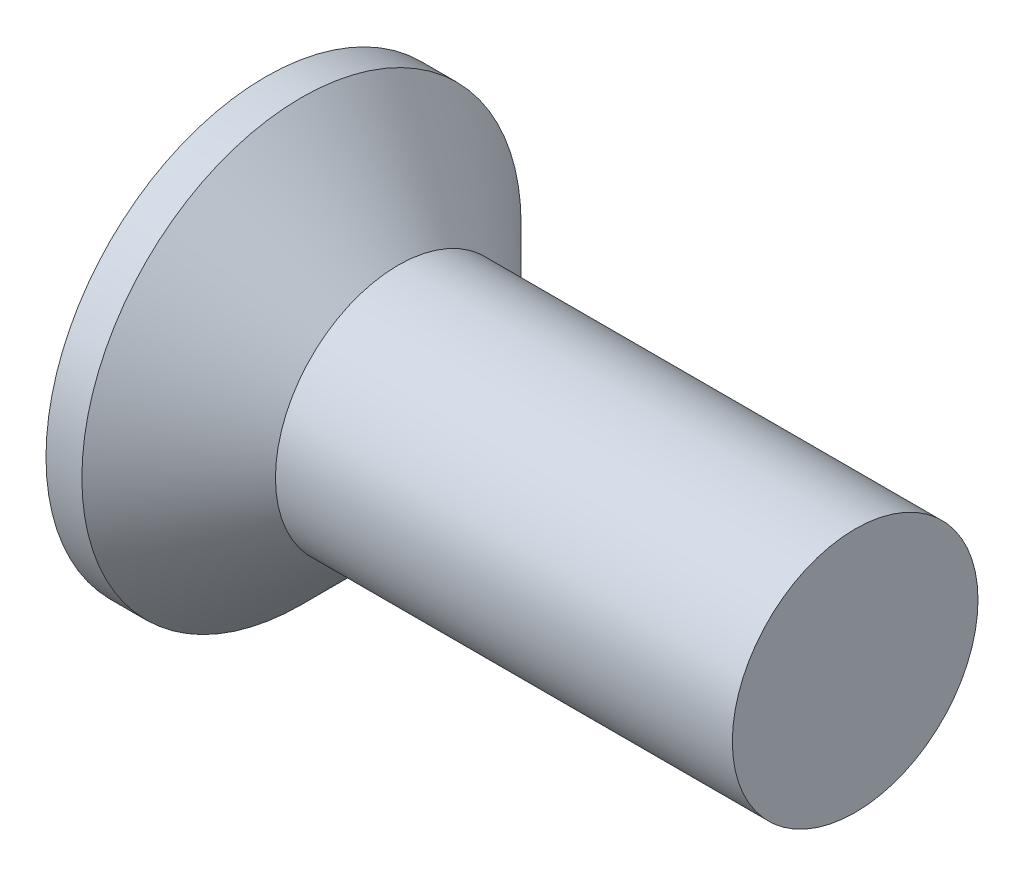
ISO-10303-21;
HEADER;
FILE_DESCRIPTION(('STEP AP214'),'2;1');
FILE_NAME('part.step','',(''),(''),'','','');
FILE_SCHEMA(('AUTOMOTIVE_DESIGN { 1 0 10303 214 1 1 1 1 }'));
ENDSEC;
DATA;
#1=APPLICATION_CONTEXT('core data for automotive mechanical design processes');
#2=APPLICATION_PROTOCOL_DEFINITION('international standard','automotive_design',2000,#1);
#3=PRODUCT_CONTEXT('',#1,'mechanical');
#4=PRODUCT('Part','Part','',(#3));
#5=PRODUCT_RELATED_PRODUCT_CATEGORY('part','',(#4));
#6=PRODUCT_DEFINITION_FORMATION('','',#4);
#7=PRODUCT_DEFINITION_CONTEXT('part definition',#1,'design');
#8=PRODUCT_DEFINITION('design','',#6,#7);
#9=PRODUCT_DEFINITION_SHAPE('','',#8);
#10=(LENGTH_UNIT() NAMED_UNIT(*) SI_UNIT(.MILLI.,.METRE.));
#11=(NAMED_UNIT(*) PLANE_ANGLE_UNIT() SI_UNIT($,.RADIAN.));
#12=(NAMED_UNIT(*) SI_UNIT($,.STERADIAN.) SOLID_ANGLE_UNIT());
#13=UNCERTAINTY_MEASURE_WITH_UNIT(LENGTH_MEASURE(1.E-05),#10,'distance_accuracy_value','');
#14=(GEOMETRIC_REPRESENTATION_CONTEXT(3) GLOBAL_UNCERTAINTY_ASSIGNED_CONTEXT((#13)) GLOBAL_UNIT_ASSIGNED_CONTEXT((#10,
#11,#12)) REPRESENTATION_CONTEXT('',''));
#15=CARTESIAN_POINT('',(0.,0.,0.));
#16=DIRECTION('',(0.,0.,1.));
#17=DIRECTION('',(1.,0.,0.));
#18=AXIS2_PLACEMENT_3D('',#15,#16,#17);
#19=CARTESIAN_POINT('',(0.,4.46999999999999,0.));
#20=DIRECTION('',(-1.,0.,0.));
#21=DIRECTION('',(0.,0.,1.));
#22=AXIS2_PLACEMENT_3D('',#19,#20,#21);
#23=PLANE('',#22);
#24=CARTESIAN_POINT('',(0.,0.,0.));
#25=DIRECTION('',(1.,0.,0.));
#26=DIRECTION('',(0.,0.,-1.));
#27=AXIS2_PLACEMENT_3D('',#24,#25,#26);
#28=CIRCLE('',#27,4.46999999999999);
#29=CARTESIAN_POINT('',(0.,0.,-4.46999999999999));
#30=VERTEX_POINT('',#29);
#31=EDGE_CURVE('E181',#30,#30,#28,.T.);
#32=ORIENTED_EDGE('',*,*,#31,.F.);
#33=EDGE_LOOP('',(#32));
#34=FACE_BOUND('',#33,.T.);
#35=DIRECTION('',(0.,1.,0.));
#36=VECTOR('',#35,1.);
#37=CARTESIAN_POINT('',(0.,-0.52,-0.52));
#38=LINE('',#37,#36);
#39=CARTESIAN_POINT('',(0.,-2.6,-0.52));
#40=VERTEX_POINT('',#39);
#41=CARTESIAN_POINT('',(0.,-0.82,-0.52));
#42=VERTEX_POINT('',#41);
#43=EDGE_CURVE('E307',#40,#42,#38,.T.);
#44=ORIENTED_EDGE('',*,*,#43,.T.);
#45=CARTESIAN_POINT('',(0.,-0.82,-0.82));
#46=DIRECTION('',(-1.,0.,0.));
#47=DIRECTION('',(0.,0.,1.));
#48=AXIS2_PLACEMENT_3D('',#45,#46,#47);
#49=CIRCLE('',#48,0.3);
#50=CARTESIAN_POINT('',(0.,-0.52,-0.82));
#51=VERTEX_POINT('',#50);
#52=EDGE_CURVE('E186',#42,#51,#49,.T.);
#53=ORIENTED_EDGE('',*,*,#52,.T.);
#54=DIRECTION('',(0.,0.,-1.));
#55=VECTOR('',#54,1.);
#56=CARTESIAN_POINT('',(0.,-0.52,-0.52));
#57=LINE('',#56,#55);
#58=CARTESIAN_POINT('',(0.,-0.52,-2.6));
#59=VERTEX_POINT('',#58);
#60=EDGE_CURVE('E309',#51,#59,#57,.T.);
#61=ORIENTED_EDGE('',*,*,#60,.T.);
#62=DIRECTION('',(0.,1.,0.));
#63=VECTOR('',#62,1.);
#64=CARTESIAN_POINT('',(0.,0.52,-2.6));
#65=LINE('',#64,#63);
#66=CARTESIAN_POINT('',(0.,0.52,-2.6));
#67=VERTEX_POINT('',#66);
#68=EDGE_CURVE('E311',#59,#67,#65,.T.);
#69=ORIENTED_EDGE('',*,*,#68,.T.);
#70=DIRECTION('',(0.,0.,1.));
#71=VECTOR('',#70,1.);
#72=CARTESIAN_POINT('',(0.,0.52,-0.52));
#73=LINE('',#72,#71);
#74=CARTESIAN_POINT('',(0.,0.52,-0.82));
#75=VERTEX_POINT('',#74);
#76=EDGE_CURVE('E314',#67,#75,#73,.T.);
#77=ORIENTED_EDGE('',*,*,#76,.T.);
#78=CARTESIAN_POINT('',(0.,0.82,-0.82));
#79=DIRECTION('',(-1.,0.,0.));
#80=DIRECTION('',(0.,0.,1.));
#81=AXIS2_PLACEMENT_3D('',#78,#79,#80);
#82=CIRCLE('',#81,0.3);
#83=CARTESIAN_POINT('',(0.,0.82,-0.52));
#84=VERTEX_POINT('',#83);
#85=EDGE_CURVE('E184',#75,#84,#82,.T.);
#86=ORIENTED_EDGE('',*,*,#85,.T.);
#87=DIRECTION('',(0.,1.,0.));
#88=VECTOR('',#87,1.);
#89=CARTESIAN_POINT('',(0.,0.52,-0.52));
#90=LINE('',#89,#88);
#91=CARTESIAN_POINT('',(0.,2.6,-0.52));
#92=VERTEX_POINT('',#91);
#93=EDGE_CURVE('E317',#84,#92,#90,.T.);
#94=ORIENTED_EDGE('',*,*,#93,.T.);
#95=DIRECTION('',(0.,0.,1.));
#96=VECTOR('',#95,1.);
#97=CARTESIAN_POINT('',(0.,2.6,-0.52));
#98=LINE('',#97,#96);
#99=CARTESIAN_POINT('',(0.,2.6,0.52));
#100=VERTEX_POINT('',#99);
#101=EDGE_CURVE('E319',#92,#100,#98,.T.);
#102=ORIENTED_EDGE('',*,*,#101,.T.);
#103=DIRECTION('',(0.,-1.,0.));
#104=VECTOR('',#103,1.);
#105=CARTESIAN_POINT('',(0.,0.52,0.52));
#106=LINE('',#105,#104);
#107=CARTESIAN_POINT('',(0.,0.82,0.52));
#108=VERTEX_POINT('',#107);
#109=EDGE_CURVE('E322',#100,#108,#106,.T.);
#110=ORIENTED_EDGE('',*,*,#109,.T.);
#111=CARTESIAN_POINT('',(0.,0.82,0.82));
#112=DIRECTION('',(-1.,0.,0.));
#113=DIRECTION('',(0.,0.,1.));
#114=AXIS2_PLACEMENT_3D('',#111,#112,#113);
#115=CIRCLE('',#114,0.3);
#116=CARTESIAN_POINT('',(0.,0.52,0.82));
#117=VERTEX_POINT('',#116);
#118=EDGE_CURVE('E149',#108,#117,#115,.T.);
#119=ORIENTED_EDGE('',*,*,#118,.T.);
#120=DIRECTION('',(0.,0.,1.));
#121=VECTOR('',#120,1.);
#122=CARTESIAN_POINT('',(0.,0.52,0.52));
#123=LINE('',#122,#121);
#124=CARTESIAN_POINT('',(0.,0.519999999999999,2.6));
#125=VERTEX_POINT('',#124);
#126=EDGE_CURVE('E143',#117,#125,#123,.T.);
#127=ORIENTED_EDGE('',*,*,#126,.T.);
#128=DIRECTION('',(0.,-1.,0.));
#129=VECTOR('',#128,1.);
#130=CARTESIAN_POINT('',(0.,0.519999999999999,2.6));
#131=LINE('',#130,#129);
#132=CARTESIAN_POINT('',(0.,-0.520000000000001,2.6));
#133=VERTEX_POINT('',#132);
#134=EDGE_CURVE('E147',#125,#133,#131,.T.);
#135=ORIENTED_EDGE('',*,*,#134,.T.);
#136=DIRECTION('',(0.,0.,-1.));
#137=VECTOR('',#136,1.);
#138=CARTESIAN_POINT('',(0.,-0.52,0.52));
#139=LINE('',#138,#137);
#140=CARTESIAN_POINT('',(0.,-0.52,0.82));
#141=VERTEX_POINT('',#140);
#142=EDGE_CURVE('E161',#133,#141,#139,.T.);
#143=ORIENTED_EDGE('',*,*,#142,.T.);
#144=CARTESIAN_POINT('',(0.,-0.82,0.819999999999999));
#145=DIRECTION('',(-1.,0.,0.));
#146=DIRECTION('',(0.,0.,1.));
#147=AXIS2_PLACEMENT_3D('',#144,#145,#146);
#148=CIRCLE('',#147,0.3);
#149=CARTESIAN_POINT('',(0.,-0.82,0.52));
#150=VERTEX_POINT('',#149);
#151=EDGE_CURVE('E180',#141,#150,#148,.T.);
#152=ORIENTED_EDGE('',*,*,#151,.T.);
#153=DIRECTION('',(0.,-1.,0.));
#154=VECTOR('',#153,1.);
#155=CARTESIAN_POINT('',(0.,-0.52,0.52));
#156=LINE('',#155,#154);
#157=CARTESIAN_POINT('',(0.,-2.6,0.519999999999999));
#158=VERTEX_POINT('',#157);
#159=EDGE_CURVE('E302',#150,#158,#156,.T.);
#160=ORIENTED_EDGE('',*,*,#159,.T.);
#161=DIRECTION('',(0.,0.,-1.));
#162=VECTOR('',#161,1.);
#163=CARTESIAN_POINT('',(0.,-2.6,-0.52));
#164=LINE('',#163,#162);
#165=EDGE_CURVE('E304',#158,#40,#164,.T.);
#166=ORIENTED_EDGE('',*,*,#165,.T.);
#167=EDGE_LOOP('',(#44,#53,#61,#69,#77,#86,#94,#102,#110,#119,#127,#135,#143,#152,#160,#166));
#168=FACE_BOUND('',#167,.T.);
#169=ADVANCED_FACE('F30',(#34,#168),#23,.T.);
#170=CARTESIAN_POINT('',(12.,2.49999999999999,0.));
#171=DIRECTION('',(1.,0.,0.));
#172=DIRECTION('',(0.,0.,-1.));
#173=AXIS2_PLACEMENT_3D('',#170,#171,#172);
#174=PLANE('',#173);
#175=CARTESIAN_POINT('',(12.,0.,0.));
#176=DIRECTION('',(1.,0.,0.));
#177=DIRECTION('',(0.,0.,-1.));
#178=AXIS2_PLACEMENT_3D('',#175,#176,#177);
#179=CIRCLE('',#178,2.49999999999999);
#180=CARTESIAN_POINT('',(12.,0.,-2.49999999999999));
#181=VERTEX_POINT('',#180);
#182=EDGE_CURVE('E167',#181,#181,#179,.T.);
#183=ORIENTED_EDGE('',*,*,#182,.T.);
#184=EDGE_LOOP('',(#183));
#185=FACE_BOUND('',#184,.T.);
#186=ADVANCED_FACE('F234',(#185),#174,.T.);
#187=CARTESIAN_POINT('',(4.51581291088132,0.,0.));
#188=DIRECTION('',(1.,0.,0.));
#189=DIRECTION('',(0.,0.,-1.));
#190=AXIS2_PLACEMENT_3D('',#187,#188,#189);
#191=CYLINDRICAL_SURFACE('',#190,4.46999999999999);
#192=ORIENTED_EDGE('',*,*,#31,.T.);
#193=EDGE_LOOP('',(#192));
#194=FACE_BOUND('',#193,.T.);
#195=CARTESIAN_POINT('',(0.730000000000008,0.,0.));
#196=DIRECTION('',(1.,0.,0.));
#197=DIRECTION('',(0.,0.,-1.));
#198=AXIS2_PLACEMENT_3D('',#195,#196,#197);
#199=CIRCLE('',#198,4.46999999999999);
#200=CARTESIAN_POINT('',(0.730000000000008,0.,-4.46999999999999));
#201=VERTEX_POINT('',#200);
#202=EDGE_CURVE('E326',#201,#201,#199,.T.);
#203=ORIENTED_EDGE('',*,*,#202,.F.);
#204=EDGE_LOOP('',(#203));
#205=FACE_BOUND('',#204,.T.);
#206=ADVANCED_FACE('F240',(#194,#205),#191,.T.);
#207=CARTESIAN_POINT('',(2.7,0.,0.));
#208=DIRECTION('',(-1.,0.,0.));
#209=DIRECTION('',(0.,0.,1.));
#210=AXIS2_PLACEMENT_3D('',#207,#208,#209);
#211=CONICAL_SURFACE('',#210,2.49999999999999,0.78539816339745);
#212=ORIENTED_EDGE('',*,*,#202,.T.);
#213=EDGE_LOOP('',(#212));
#214=FACE_BOUND('',#213,.T.);
#215=CARTESIAN_POINT('',(2.7,0.,0.));
#216=DIRECTION('',(1.,0.,0.));
#217=DIRECTION('',(0.,0.,-1.));
#218=AXIS2_PLACEMENT_3D('',#215,#216,#217);
#219=CIRCLE('',#218,2.49999999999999);
#220=CARTESIAN_POINT('',(2.7,0.,-2.49999999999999));
#221=VERTEX_POINT('',#220);
#222=EDGE_CURVE('E170',#221,#221,#219,.T.);
#223=ORIENTED_EDGE('',*,*,#222,.F.);
#224=EDGE_LOOP('',(#223));
#225=FACE_BOUND('',#224,.T.);
#226=ADVANCED_FACE('F362',(#214,#225),#211,.T.);
#227=CARTESIAN_POINT('',(4.51581291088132,0.,0.));
#228=DIRECTION('',(1.,0.,0.));
#229=DIRECTION('',(0.,0.,-1.));
#230=AXIS2_PLACEMENT_3D('',#227,#228,#229);
#231=CYLINDRICAL_SURFACE('',#230,2.49999999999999);
#232=ORIENTED_EDGE('',*,*,#222,.T.);
#233=EDGE_LOOP('',(#232));
#234=FACE_BOUND('',#233,.T.);
#235=ORIENTED_EDGE('',*,*,#182,.F.);
#236=EDGE_LOOP('',(#235));
#237=FACE_BOUND('',#236,.T.);
#238=ADVANCED_FACE('F360',(#234,#237),#231,.T.);
#239=CARTESIAN_POINT('',(1.35,0.52,0.52));
#240=DIRECTION('',(0.,-1.,0.));
#241=DIRECTION('',(0.,0.,-1.));
#242=AXIS2_PLACEMENT_3D('',#239,#240,#241);
#243=PLANE('',#242);
#244=ORIENTED_EDGE('',*,*,#126,.F.);
#245=DIRECTION('',(-1.,0.,0.));
#246=VECTOR('',#245,1.);
#247=CARTESIAN_POINT('',(1.35,0.52,0.82));
#248=LINE('',#247,#246);
#249=CARTESIAN_POINT('',(1.35,0.52,0.82));
#250=VERTEX_POINT('',#249);
#251=EDGE_CURVE('E198',#117,#250,#248,.F.);
#252=ORIENTED_EDGE('',*,*,#251,.T.);
#253=DIRECTION('',(0.,0.,1.));
#254=VECTOR('',#253,1.);
#255=CARTESIAN_POINT('',(1.35,0.52,0.52));
#256=LINE('',#255,#254);
#257=CARTESIAN_POINT('',(1.35,0.52,1.820577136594));
#258=VERTEX_POINT('',#257);
#259=EDGE_CURVE('E165',#250,#258,#256,.T.);
#260=ORIENTED_EDGE('',*,*,#259,.T.);
#261=DIRECTION('',(-0.866025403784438,0.,0.500000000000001));
#262=VECTOR('',#261,1.);
#263=CARTESIAN_POINT('',(0.,0.519999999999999,2.6));
#264=LINE('',#263,#262);
#265=EDGE_CURVE('E157',#258,#125,#264,.T.);
#266=ORIENTED_EDGE('',*,*,#265,.T.);
#267=EDGE_LOOP('',(#244,#252,#260,#266));
#268=FACE_BOUND('',#267,.T.);
#269=ADVANCED_FACE('F163',(#268),#243,.T.);
#270=CARTESIAN_POINT('',(0.,0.519999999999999,2.6));
#271=DIRECTION('',(-0.500000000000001,0.,-0.866025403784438));
#272=DIRECTION('',(-0.866025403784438,0.,0.500000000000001));
#273=AXIS2_PLACEMENT_3D('',#270,#271,#272);
#274=PLANE('',#273);
#275=ORIENTED_EDGE('',*,*,#134,.F.);
#276=ORIENTED_EDGE('',*,*,#265,.F.);
#277=DIRECTION('',(0.,-1.,0.));
#278=VECTOR('',#277,1.);
#279=CARTESIAN_POINT('',(1.35,0.52,1.820577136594));
#280=LINE('',#279,#278);
#281=CARTESIAN_POINT('',(1.35,-0.52,1.820577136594));
#282=VERTEX_POINT('',#281);
#283=EDGE_CURVE('E176',#258,#282,#280,.T.);
#284=ORIENTED_EDGE('',*,*,#283,.T.);
#285=DIRECTION('',(-0.866025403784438,0.,0.500000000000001));
#286=VECTOR('',#285,1.);
#287=CARTESIAN_POINT('',(1.91316641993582,-0.52,1.4954328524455));
#288=LINE('',#287,#286);
#289=EDGE_CURVE('E159',#282,#133,#288,.T.);
#290=ORIENTED_EDGE('',*,*,#289,.T.);
#291=EDGE_LOOP('',(#275,#276,#284,#290));
#292=FACE_BOUND('',#291,.T.);
#293=ADVANCED_FACE('F156',(#292),#274,.T.);
#294=CARTESIAN_POINT('',(1.35,-0.52,0.52));
#295=DIRECTION('',(0.,1.,0.));
#296=DIRECTION('',(0.,0.,1.));
#297=AXIS2_PLACEMENT_3D('',#294,#295,#296);
#298=PLANE('',#297);
#299=DIRECTION('',(0.,0.,-1.));
#300=VECTOR('',#299,1.);
#301=CARTESIAN_POINT('',(1.35,-0.52,0.52));
#302=LINE('',#301,#300);
#303=CARTESIAN_POINT('',(1.35,-0.52,0.82));
#304=VERTEX_POINT('',#303);
#305=EDGE_CURVE('E348',#282,#304,#302,.T.);
#306=ORIENTED_EDGE('',*,*,#305,.T.);
#307=DIRECTION('',(-1.,0.,0.));
#308=VECTOR('',#307,1.);
#309=CARTESIAN_POINT('',(1.35,-0.52,0.82));
#310=LINE('',#309,#308);
#311=EDGE_CURVE('E200',#304,#141,#310,.T.);
#312=ORIENTED_EDGE('',*,*,#311,.T.);
#313=ORIENTED_EDGE('',*,*,#142,.F.);
#314=ORIENTED_EDGE('',*,*,#289,.F.);
#315=EDGE_LOOP('',(#306,#312,#313,#314));
#316=FACE_BOUND('',#315,.T.);
#317=ADVANCED_FACE('F254',(#316),#298,.T.);
#318=CARTESIAN_POINT('',(1.35,-0.52,0.52));
#319=DIRECTION('',(0.,0.,-1.));
#320=DIRECTION('',(0.,1.,0.));
#321=AXIS2_PLACEMENT_3D('',#318,#319,#320);
#322=PLANE('',#321);
#323=ORIENTED_EDGE('',*,*,#159,.F.);
#324=DIRECTION('',(-1.,0.,0.));
#325=VECTOR('',#324,1.);
#326=CARTESIAN_POINT('',(1.35,-0.82,0.52));
#327=LINE('',#326,#325);
#328=CARTESIAN_POINT('',(1.35,-0.82,0.52));
#329=VERTEX_POINT('',#328);
#330=EDGE_CURVE('E45',#150,#329,#327,.F.);
#331=ORIENTED_EDGE('',*,*,#330,.T.);
#332=DIRECTION('',(0.,-1.,0.));
#333=VECTOR('',#332,1.);
#334=CARTESIAN_POINT('',(1.35,-0.52,0.52));
#335=LINE('',#334,#333);
#336=CARTESIAN_POINT('',(1.35,-1.820577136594,0.519999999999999));
#337=VERTEX_POINT('',#336);
#338=EDGE_CURVE('E291',#329,#337,#335,.T.);
#339=ORIENTED_EDGE('',*,*,#338,.T.);
#340=DIRECTION('',(-0.866025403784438,-0.500000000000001,0.));
#341=VECTOR('',#340,1.);
#342=CARTESIAN_POINT('',(0.,-2.6,0.519999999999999));
#343=LINE('',#342,#341);
#344=EDGE_CURVE('E172',#337,#158,#343,.T.);
#345=ORIENTED_EDGE('',*,*,#344,.T.);
#346=EDGE_LOOP('',(#323,#331,#339,#345));
#347=FACE_BOUND('',#346,.T.);
#348=ADVANCED_FACE('F259',(#347),#322,.T.);
#349=CARTESIAN_POINT('',(0.,-2.6,-0.52));
#350=DIRECTION('',(-0.500000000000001,0.866025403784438,0.));
#351=DIRECTION('',(-0.866025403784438,-0.500000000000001,0.));
#352=AXIS2_PLACEMENT_3D('',#349,#350,#351);
#353=PLANE('',#352);
#354=ORIENTED_EDGE('',*,*,#165,.F.);
#355=ORIENTED_EDGE('',*,*,#344,.F.);
#356=DIRECTION('',(0.,0.,-1.));
#357=VECTOR('',#356,1.);
#358=CARTESIAN_POINT('',(1.35,-1.820577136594,-0.52));
#359=LINE('',#358,#357);
#360=CARTESIAN_POINT('',(1.35,-1.820577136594,-0.52));
#361=VERTEX_POINT('',#360);
#362=EDGE_CURVE('E287',#337,#361,#359,.T.);
#363=ORIENTED_EDGE('',*,*,#362,.T.);
#364=DIRECTION('',(-0.866025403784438,-0.500000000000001,0.));
#365=VECTOR('',#364,1.);
#366=CARTESIAN_POINT('',(1.91316641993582,-1.4954328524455,-0.52));
#367=LINE('',#366,#365);
#368=EDGE_CURVE('E286',#361,#40,#367,.T.);
#369=ORIENTED_EDGE('',*,*,#368,.T.);
#370=EDGE_LOOP('',(#354,#355,#363,#369));
#371=FACE_BOUND('',#370,.T.);
#372=ADVANCED_FACE('F255',(#371),#353,.T.);
#373=CARTESIAN_POINT('',(1.35,-0.52,-0.52));
#374=DIRECTION('',(0.,0.,1.));
#375=DIRECTION('',(0.,-1.,0.));
#376=AXIS2_PLACEMENT_3D('',#373,#374,#375);
#377=PLANE('',#376);
#378=DIRECTION('',(0.,1.,0.));
#379=VECTOR('',#378,1.);
#380=CARTESIAN_POINT('',(1.35,-0.52,-0.52));
#381=LINE('',#380,#379);
#382=CARTESIAN_POINT('',(1.35,-0.82,-0.52));
#383=VERTEX_POINT('',#382);
#384=EDGE_CURVE('E280',#361,#383,#381,.T.);
#385=ORIENTED_EDGE('',*,*,#384,.T.);
#386=DIRECTION('',(-1.,0.,0.));
#387=VECTOR('',#386,1.);
#388=CARTESIAN_POINT('',(1.35,-0.82,-0.52));
#389=LINE('',#388,#387);
#390=EDGE_CURVE('E177',#383,#42,#389,.T.);
#391=ORIENTED_EDGE('',*,*,#390,.T.);
#392=ORIENTED_EDGE('',*,*,#43,.F.);
#393=ORIENTED_EDGE('',*,*,#368,.F.);
#394=EDGE_LOOP('',(#385,#391,#392,#393));
#395=FACE_BOUND('',#394,.T.);
#396=ADVANCED_FACE('F258',(#395),#377,.T.);
#397=CARTESIAN_POINT('',(1.35,-0.52,-0.52));
#398=DIRECTION('',(0.,1.,0.));
#399=DIRECTION('',(0.,0.,1.));
#400=AXIS2_PLACEMENT_3D('',#397,#398,#399);
#401=PLANE('',#400);
#402=ORIENTED_EDGE('',*,*,#60,.F.);
#403=DIRECTION('',(-1.,0.,0.));
#404=VECTOR('',#403,1.);
#405=CARTESIAN_POINT('',(1.35,-0.52,-0.82));
#406=LINE('',#405,#404);
#407=CARTESIAN_POINT('',(1.35,-0.52,-0.82));
#408=VERTEX_POINT('',#407);
#409=EDGE_CURVE('E188',#51,#408,#406,.F.);
#410=ORIENTED_EDGE('',*,*,#409,.T.);
#411=DIRECTION('',(0.,0.,-1.));
#412=VECTOR('',#411,1.);
#413=CARTESIAN_POINT('',(1.35,-0.52,-0.52));
#414=LINE('',#413,#412);
#415=CARTESIAN_POINT('',(1.35,-0.52,-1.820577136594));
#416=VERTEX_POINT('',#415);
#417=EDGE_CURVE('E282',#408,#416,#414,.T.);
#418=ORIENTED_EDGE('',*,*,#417,.T.);
#419=DIRECTION('',(-0.866025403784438,0.,-0.500000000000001));
#420=VECTOR('',#419,1.);
#421=CARTESIAN_POINT('',(0.,-0.52,-2.6));
#422=LINE('',#421,#420);
#423=EDGE_CURVE('E338',#416,#59,#422,.T.);
#424=ORIENTED_EDGE('',*,*,#423,.T.);
#425=EDGE_LOOP('',(#402,#410,#418,#424));
#426=FACE_BOUND('',#425,.T.);
#427=ADVANCED_FACE('F265',(#426),#401,.T.);
#428=CARTESIAN_POINT('',(0.,0.52,-2.6));
#429=DIRECTION('',(-0.500000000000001,0.,0.866025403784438));
#430=DIRECTION('',(0.866025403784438,0.,0.500000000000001));
#431=AXIS2_PLACEMENT_3D('',#428,#429,#430);
#432=PLANE('',#431);
#433=ORIENTED_EDGE('',*,*,#68,.F.);
#434=ORIENTED_EDGE('',*,*,#423,.F.);
#435=DIRECTION('',(0.,1.,0.));
#436=VECTOR('',#435,1.);
#437=CARTESIAN_POINT('',(1.35,0.52,-1.820577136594));
#438=LINE('',#437,#436);
#439=CARTESIAN_POINT('',(1.35,0.52,-1.820577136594));
#440=VERTEX_POINT('',#439);
#441=EDGE_CURVE('E289',#416,#440,#438,.T.);
#442=ORIENTED_EDGE('',*,*,#441,.T.);
#443=DIRECTION('',(-0.866025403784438,0.,-0.500000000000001));
#444=VECTOR('',#443,1.);
#445=CARTESIAN_POINT('',(1.91316641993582,0.52,-1.4954328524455));
#446=LINE('',#445,#444);
#447=EDGE_CURVE('E336',#440,#67,#446,.T.);
#448=ORIENTED_EDGE('',*,*,#447,.T.);
#449=EDGE_LOOP('',(#433,#434,#442,#448));
#450=FACE_BOUND('',#449,.T.);
#451=ADVANCED_FACE('F261',(#450),#432,.T.);
#452=CARTESIAN_POINT('',(1.35,0.52,-0.52));
#453=DIRECTION('',(0.,-1.,0.));
#454=DIRECTION('',(0.,0.,-1.));
#455=AXIS2_PLACEMENT_3D('',#452,#453,#454);
#456=PLANE('',#455);
#457=DIRECTION('',(0.,0.,1.));
#458=VECTOR('',#457,1.);
#459=CARTESIAN_POINT('',(1.35,0.52,-0.52));
#460=LINE('',#459,#458);
#461=CARTESIAN_POINT('',(1.35,0.52,-0.82));
#462=VERTEX_POINT('',#461);
#463=EDGE_CURVE('E296',#440,#462,#460,.T.);
#464=ORIENTED_EDGE('',*,*,#463,.T.);
#465=DIRECTION('',(-1.,0.,0.));
#466=VECTOR('',#465,1.);
#467=CARTESIAN_POINT('',(1.35,0.52,-0.82));
#468=LINE('',#467,#466);
#469=EDGE_CURVE('E190',#462,#75,#468,.T.);
#470=ORIENTED_EDGE('',*,*,#469,.T.);
#471=ORIENTED_EDGE('',*,*,#76,.F.);
#472=ORIENTED_EDGE('',*,*,#447,.F.);
#473=EDGE_LOOP('',(#464,#470,#471,#472));
#474=FACE_BOUND('',#473,.T.);
#475=ADVANCED_FACE('F264',(#474),#456,.T.);
#476=CARTESIAN_POINT('',(1.35,0.52,-0.52));
#477=DIRECTION('',(0.,0.,1.));
#478=DIRECTION('',(0.,-1.,0.));
#479=AXIS2_PLACEMENT_3D('',#476,#477,#478);
#480=PLANE('',#479);
#481=ORIENTED_EDGE('',*,*,#93,.F.);
#482=DIRECTION('',(-1.,0.,0.));
#483=VECTOR('',#482,1.);
#484=CARTESIAN_POINT('',(1.35,0.82,-0.52));
#485=LINE('',#484,#483);
#486=CARTESIAN_POINT('',(1.35,0.82,-0.52));
#487=VERTEX_POINT('',#486);
#488=EDGE_CURVE('E193',#84,#487,#485,.F.);
#489=ORIENTED_EDGE('',*,*,#488,.T.);
#490=DIRECTION('',(0.,1.,0.));
#491=VECTOR('',#490,1.);
#492=CARTESIAN_POINT('',(1.35,0.52,-0.52));
#493=LINE('',#492,#491);
#494=CARTESIAN_POINT('',(1.35,1.820577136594,-0.52));
#495=VERTEX_POINT('',#494);
#496=EDGE_CURVE('E299',#487,#495,#493,.T.);
#497=ORIENTED_EDGE('',*,*,#496,.T.);
#498=DIRECTION('',(-0.866025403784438,0.500000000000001,0.));
#499=VECTOR('',#498,1.);
#500=CARTESIAN_POINT('',(0.,2.6,-0.52));
#501=LINE('',#500,#499);
#502=EDGE_CURVE('E332',#495,#92,#501,.T.);
#503=ORIENTED_EDGE('',*,*,#502,.T.);
#504=EDGE_LOOP('',(#481,#489,#497,#503));
#505=FACE_BOUND('',#504,.T.);
#506=ADVANCED_FACE('F250',(#505),#480,.T.);
#507=CARTESIAN_POINT('',(0.,2.6,-0.52));
#508=DIRECTION('',(-0.500000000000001,-0.866025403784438,0.));
#509=DIRECTION('',(0.866025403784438,-0.500000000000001,0.));
#510=AXIS2_PLACEMENT_3D('',#507,#508,#509);
#511=PLANE('',#510);
#512=ORIENTED_EDGE('',*,*,#101,.F.);
#513=ORIENTED_EDGE('',*,*,#502,.F.);
#514=DIRECTION('',(0.,0.,1.));
#515=VECTOR('',#514,1.);
#516=CARTESIAN_POINT('',(1.35,1.820577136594,-0.52));
#517=LINE('',#516,#515);
#518=CARTESIAN_POINT('',(1.35,1.820577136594,0.52));
#519=VERTEX_POINT('',#518);
#520=EDGE_CURVE('E220',#495,#519,#517,.T.);
#521=ORIENTED_EDGE('',*,*,#520,.T.);
#522=DIRECTION('',(-0.866025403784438,0.500000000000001,0.));
#523=VECTOR('',#522,1.);
#524=CARTESIAN_POINT('',(1.91316641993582,1.4954328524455,0.52));
#525=LINE('',#524,#523);
#526=EDGE_CURVE('E219',#519,#100,#525,.T.);
#527=ORIENTED_EDGE('',*,*,#526,.T.);
#528=EDGE_LOOP('',(#512,#513,#521,#527));
#529=FACE_BOUND('',#528,.T.);
#530=ADVANCED_FACE('F247',(#529),#511,.T.);
#531=CARTESIAN_POINT('',(1.35,0.52,0.52));
#532=DIRECTION('',(0.,0.,-1.));
#533=DIRECTION('',(0.,1.,0.));
#534=AXIS2_PLACEMENT_3D('',#531,#532,#533);
#535=PLANE('',#534);
#536=DIRECTION('',(0.,-1.,0.));
#537=VECTOR('',#536,1.);
#538=CARTESIAN_POINT('',(1.35,0.52,0.52));
#539=LINE('',#538,#537);
#540=CARTESIAN_POINT('',(1.35,0.82,0.52));
#541=VERTEX_POINT('',#540);
#542=EDGE_CURVE('E212',#519,#541,#539,.T.);
#543=ORIENTED_EDGE('',*,*,#542,.T.);
#544=DIRECTION('',(-1.,0.,0.));
#545=VECTOR('',#544,1.);
#546=CARTESIAN_POINT('',(1.35,0.82,0.52));
#547=LINE('',#546,#545);
#548=EDGE_CURVE('E195',#541,#108,#547,.T.);
#549=ORIENTED_EDGE('',*,*,#548,.T.);
#550=ORIENTED_EDGE('',*,*,#109,.F.);
#551=ORIENTED_EDGE('',*,*,#526,.F.);
#552=EDGE_LOOP('',(#543,#549,#550,#551));
#553=FACE_BOUND('',#552,.T.);
#554=ADVANCED_FACE('F217',(#553),#535,.T.);
#555=CARTESIAN_POINT('',(1.35,0.52,0.52));
#556=DIRECTION('',(1.,0.,0.));
#557=DIRECTION('',(0.,0.,-1.));
#558=AXIS2_PLACEMENT_3D('',#555,#556,#557);
#559=PLANE('',#558);
#560=ORIENTED_EDGE('',*,*,#259,.F.);
#561=CARTESIAN_POINT('',(1.35,0.82,0.82));
#562=DIRECTION('',(1.,0.,0.));
#563=DIRECTION('',(0.,0.,-1.));
#564=AXIS2_PLACEMENT_3D('',#561,#562,#563);
#565=CIRCLE('',#564,0.3);
#566=EDGE_CURVE('E38',#250,#541,#565,.T.);
#567=ORIENTED_EDGE('',*,*,#566,.T.);
#568=ORIENTED_EDGE('',*,*,#542,.F.);
#569=ORIENTED_EDGE('',*,*,#520,.F.);
#570=ORIENTED_EDGE('',*,*,#496,.F.);
#571=CARTESIAN_POINT('',(1.35,0.82,-0.82));
#572=DIRECTION('',(1.,0.,0.));
#573=DIRECTION('',(0.,0.,-1.));
#574=AXIS2_PLACEMENT_3D('',#571,#572,#573);
#575=CIRCLE('',#574,0.3);
#576=EDGE_CURVE('E206',#487,#462,#575,.T.);
#577=ORIENTED_EDGE('',*,*,#576,.T.);
#578=ORIENTED_EDGE('',*,*,#463,.F.);
#579=ORIENTED_EDGE('',*,*,#441,.F.);
#580=ORIENTED_EDGE('',*,*,#417,.F.);
#581=CARTESIAN_POINT('',(1.35,-0.82,-0.82));
#582=DIRECTION('',(1.,0.,0.));
#583=DIRECTION('',(0.,0.,-1.));
#584=AXIS2_PLACEMENT_3D('',#581,#582,#583);
#585=CIRCLE('',#584,0.3);
#586=EDGE_CURVE('E204',#408,#383,#585,.T.);
#587=ORIENTED_EDGE('',*,*,#586,.T.);
#588=ORIENTED_EDGE('',*,*,#384,.F.);
#589=ORIENTED_EDGE('',*,*,#362,.F.);
#590=ORIENTED_EDGE('',*,*,#338,.F.);
#591=CARTESIAN_POINT('',(1.35,-0.82,0.819999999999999));
#592=DIRECTION('',(1.,0.,0.));
#593=DIRECTION('',(0.,0.,-1.));
#594=AXIS2_PLACEMENT_3D('',#591,#592,#593);
#595=CIRCLE('',#594,0.3);
#596=EDGE_CURVE('E11',#329,#304,#595,.T.);
#597=ORIENTED_EDGE('',*,*,#596,.T.);
#598=ORIENTED_EDGE('',*,*,#305,.F.);
#599=ORIENTED_EDGE('',*,*,#283,.F.);
#600=EDGE_LOOP('',(#560,#567,#568,#569,#570,#577,#578,#579,#580,#587,#588,#589,#590,#597,#598,#599));
#601=FACE_BOUND('',#600,.T.);
#602=ADVANCED_FACE('F210',(#601),#559,.F.);
#603=CARTESIAN_POINT('',(1.35,-0.82,-0.82));
#604=DIRECTION('',(-1.,0.,0.));
#605=DIRECTION('',(0.,0.,1.));
#606=AXIS2_PLACEMENT_3D('',#603,#604,#605);
#607=CYLINDRICAL_SURFACE('',#606,0.3);
#608=ORIENTED_EDGE('',*,*,#586,.F.);
#609=ORIENTED_EDGE('',*,*,#409,.F.);
#610=ORIENTED_EDGE('',*,*,#52,.F.);
#611=ORIENTED_EDGE('',*,*,#390,.F.);
#612=EDGE_LOOP('',(#608,#609,#610,#611));
#613=FACE_BOUND('',#612,.T.);
#614=ADVANCED_FACE('F230',(#613),#607,.T.);
#615=CARTESIAN_POINT('',(1.35,0.82,-0.82));
#616=DIRECTION('',(-1.,0.,0.));
#617=DIRECTION('',(0.,0.,1.));
#618=AXIS2_PLACEMENT_3D('',#615,#616,#617);
#619=CYLINDRICAL_SURFACE('',#618,0.3);
#620=ORIENTED_EDGE('',*,*,#576,.F.);
#621=ORIENTED_EDGE('',*,*,#488,.F.);
#622=ORIENTED_EDGE('',*,*,#85,.F.);
#623=ORIENTED_EDGE('',*,*,#469,.F.);
#624=EDGE_LOOP('',(#620,#621,#622,#623));
#625=FACE_BOUND('',#624,.T.);
#626=ADVANCED_FACE('F224',(#625),#619,.T.);
#627=CARTESIAN_POINT('',(1.35,0.82,0.82));
#628=DIRECTION('',(-1.,0.,0.));
#629=DIRECTION('',(0.,0.,1.));
#630=AXIS2_PLACEMENT_3D('',#627,#628,#629);
#631=CYLINDRICAL_SURFACE('',#630,0.3);
#632=ORIENTED_EDGE('',*,*,#566,.F.);
#633=ORIENTED_EDGE('',*,*,#251,.F.);
#634=ORIENTED_EDGE('',*,*,#118,.F.);
#635=ORIENTED_EDGE('',*,*,#548,.F.);
#636=EDGE_LOOP('',(#632,#633,#634,#635));
#637=FACE_BOUND('',#636,.T.);
#638=ADVANCED_FACE('F222',(#637),#631,.T.);
#639=CARTESIAN_POINT('',(1.35,-0.82,0.819999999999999));
#640=DIRECTION('',(-1.,0.,0.));
#641=DIRECTION('',(0.,0.,1.));
#642=AXIS2_PLACEMENT_3D('',#639,#640,#641);
#643=CYLINDRICAL_SURFACE('',#642,0.3);
#644=ORIENTED_EDGE('',*,*,#596,.F.);
#645=ORIENTED_EDGE('',*,*,#330,.F.);
#646=ORIENTED_EDGE('',*,*,#151,.F.);
#647=ORIENTED_EDGE('',*,*,#311,.F.);
#648=EDGE_LOOP('',(#644,#645,#646,#647));
#649=FACE_BOUND('',#648,.T.);
#650=ADVANCED_FACE('F32',(#649),#643,.T.);
#651=CLOSED_SHELL('',(#169,#186,#206,#226,#238,#269,#293,#317,#348,#372,#396,#427,#451,#475,
#506,#530,#554,#602,#614,#626,#638,#650));
#652=MANIFOLD_SOLID_BREP('B2',#651);
#653=ADVANCED_BREP_SHAPE_REPRESENTATION('',(#18,#652),#14);
#654=SHAPE_DEFINITION_REPRESENTATION(#9,#653);
ENDSEC;
END-ISO-10303-21;
